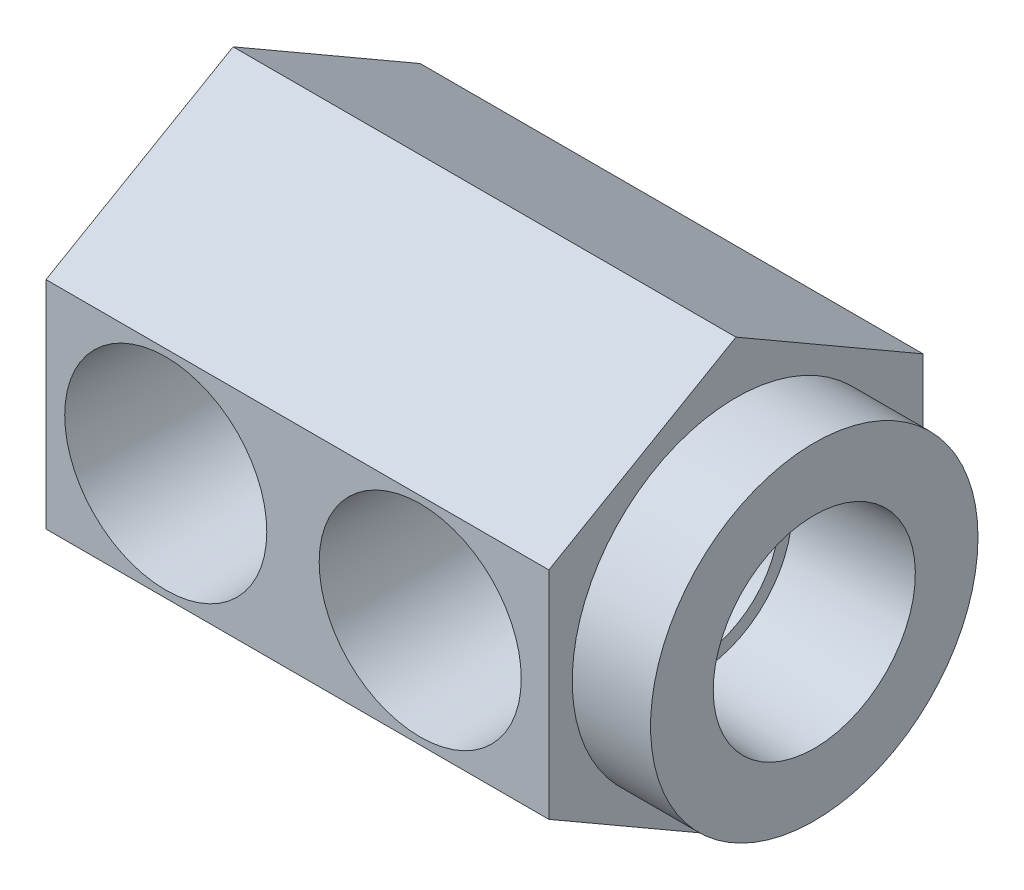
from build123d import *

# Parameters (mm, degrees)
BOSS_EXTRUDE1_DEPTH                 = 34.13125
SKETCH3_R                           = 11.1125
BOSS_EXTRUDE2_DEPTH                 = 5.31622
F_1_4_NPT_TAPPED_HOLE2_AT_2_COUNT   = 2
F_1_4_NPT_TAPPED_HOLE2_AT_2_PITCH   = 17.272
F_7_32_0_21875_DIAMETER_HOLE1_D     = 5.55625
F_7_32_0_21875_DIAMETER_HOLE1_DEPTH = 31.75
F_7_32_0_21875_DIAMETER_HOLE1_TIP   = 1.669265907
F_1_4_0_25_DIAMETER_HOLE1_D         = 6.35
F_1_4_0_25_DIAMETER_HOLE1_DEPTH     = 22.225
F_1_4_0_25_DIAMETER_HOLE1_TIP       = 1.907732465


with BuildPart() as part:
    # Sketch2 → Boss-Extrude1 (new body)
    with BuildSketch(Plane(origin=(0, 0, 0), x_dir=(0, 0, -1), z_dir=(1, 0, 0))):
        Polygon((-12.7, -7.332348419), (0, -14.664696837), (12.7, -7.332348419), (12.7, 7.332348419), (0, 14.664696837), (-12.7, 7.332348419), align=None)
    extrude(amount=BOSS_EXTRUDE1_DEPTH)

    # Sketch3 → Boss-Extrude2 (add)
    with BuildSketch(Plane(origin=(34.13125, 0, 0), x_dir=(0, 0, -1), z_dir=(1, 0, 0))):
        Circle(SKETCH3_R)
    extrude(amount=BOSS_EXTRUDE2_DEPTH)

    # Sketch4 → Cut-Revolve1 (revolve, cut)
    with BuildSketch(Plane(origin=(0, 0, 0), x_dir=(1, 0, 0), z_dir=(0, 1, 0)), mode=Mode.PRIVATE) as cut_revolve1_sk:
        Polygon((39.44747, 6.85927), (31.50997, 6.443283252), (31.50997, 5.55625), (29.92247, 5.55625), (29.92247, 0), (39.44747, 0), align=None)
    revolve(cut_revolve1_sk.sketch.rotate(Axis((-12.216170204, 0, 0), (1, 0, 0)), 180), axis=Axis((-12.216170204, 0, 0), (1, 0, 0)), mode=Mode.SUBTRACT)

    # Sketch5 → 1_4 NPT Tapped Hole1 (revolve, cut)
    with BuildSketch(Plane(origin=(8.128, 0, -12.7), x_dir=(0, 1, 0), z_dir=(1, 0, 0))):
        Polygon((0, 0), (0, 20.411147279), (5.5626, 17.0688), (5.5626, 10.0203), (6.557978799, 10.0203), (6.858, 0), align=None)
    revolve(axis=Axis((8.128, 0, -19.05), (0, 0, 1)), mode=Mode.SUBTRACT)

    # Sketch7 → 1_4 NPT Tapped Hole2 (revolve, cut)
    with BuildSketch(Plane(origin=(8.128, 0, 12.7), x_dir=(0, -1, 0), z_dir=(1, 0, 0))):
        Polygon((0, 0), (0, 20.411147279), (5.5626, 17.0688), (5.5626, 10.0203), (6.557978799, 10.0203), (6.858, 0), align=None)
    f_1_4_npt_tapped_hole2 = revolve(axis=Axis((8.128, 0, 19.05), (0, 0, -1)), mode=Mode.SUBTRACT)

    # 1_4 NPT Tapped Hole2 at 2: 1_4 NPT Tapped Hole2 ×2
    with Locations(*[(i * F_1_4_NPT_TAPPED_HOLE2_AT_2_PITCH, 0, 0) for i in range(1, F_1_4_NPT_TAPPED_HOLE2_AT_2_COUNT)]):
        add(f_1_4_npt_tapped_hole2, mode=Mode.SUBTRACT)

    # 7_32 _0.21875_ Diameter Hole1
    with Locations(Plane(origin=(39.44747, 0, 0), x_dir=(0, 0, -1), z_dir=(1, 0, 0))):
        with Locations((0, 0)):
            Hole(F_7_32_0_21875_DIAMETER_HOLE1_D / 2, depth=F_7_32_0_21875_DIAMETER_HOLE1_DEPTH)
            with Locations((0, 0, -(F_7_32_0_21875_DIAMETER_HOLE1_DEPTH + F_7_32_0_21875_DIAMETER_HOLE1_TIP / 2))):  # 118° drill point
                Cone(0, F_7_32_0_21875_DIAMETER_HOLE1_D / 2, F_7_32_0_21875_DIAMETER_HOLE1_TIP, mode=Mode.SUBTRACT)

    # 1_4 _0.25_ Diameter Hole1
    with Locations(Plane(origin=(39.44747, 0, 0), x_dir=(0, 0, -1), z_dir=(1, 0, 0))):
        with Locations((0, 0)):
            Hole(F_1_4_0_25_DIAMETER_HOLE1_D / 2, depth=F_1_4_0_25_DIAMETER_HOLE1_DEPTH)
            with Locations((0, 0, -(F_1_4_0_25_DIAMETER_HOLE1_DEPTH + F_1_4_0_25_DIAMETER_HOLE1_TIP / 2))):  # 118° drill point
                Cone(0, F_1_4_0_25_DIAMETER_HOLE1_D / 2, F_1_4_0_25_DIAMETER_HOLE1_TIP, mode=Mode.SUBTRACT)


solid = part.part
